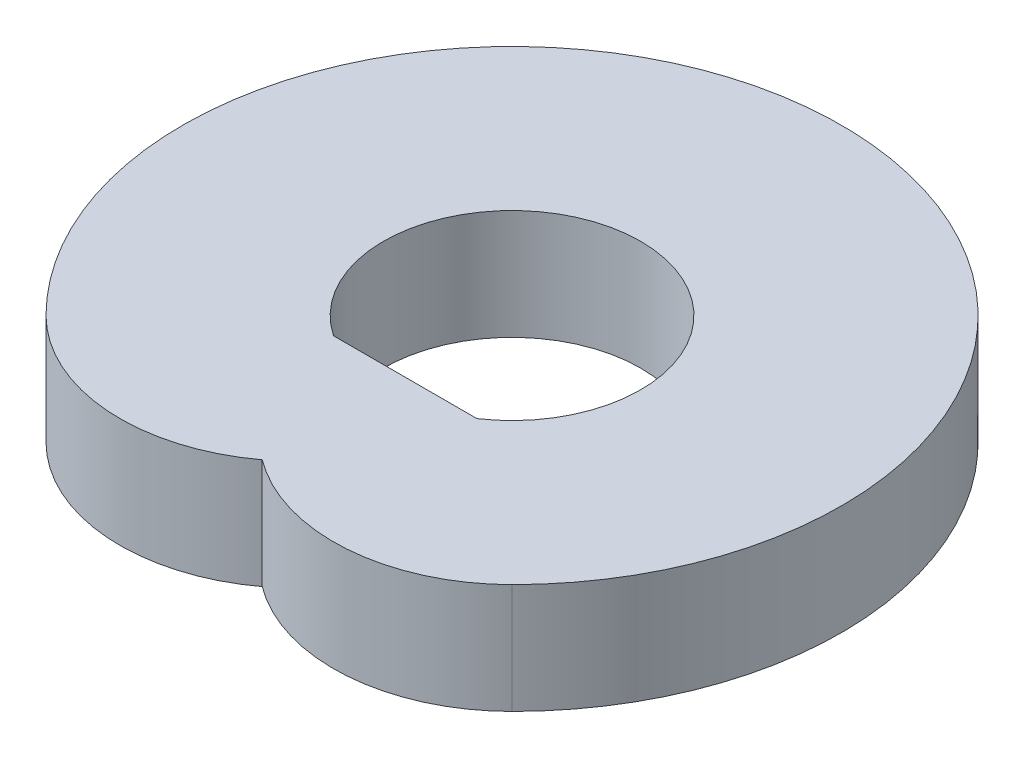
ISO-10303-21;
HEADER;
FILE_DESCRIPTION(('STEP AP214'),'2;1');
FILE_NAME('part.step','',(''),(''),'','','');
FILE_SCHEMA(('AUTOMOTIVE_DESIGN { 1 0 10303 214 1 1 1 1 }'));
ENDSEC;
DATA;
#1=APPLICATION_CONTEXT('core data for automotive mechanical design processes');
#2=APPLICATION_PROTOCOL_DEFINITION('international standard','automotive_design',2000,#1);
#3=PRODUCT_CONTEXT('',#1,'mechanical');
#4=PRODUCT('Part','Part','',(#3));
#5=PRODUCT_RELATED_PRODUCT_CATEGORY('part','',(#4));
#6=PRODUCT_DEFINITION_FORMATION('','',#4);
#7=PRODUCT_DEFINITION_CONTEXT('part definition',#1,'design');
#8=PRODUCT_DEFINITION('design','',#6,#7);
#9=PRODUCT_DEFINITION_SHAPE('','',#8);
#10=(LENGTH_UNIT() NAMED_UNIT(*) SI_UNIT(.MILLI.,.METRE.));
#11=(NAMED_UNIT(*) PLANE_ANGLE_UNIT() SI_UNIT($,.RADIAN.));
#12=(NAMED_UNIT(*) SI_UNIT($,.STERADIAN.) SOLID_ANGLE_UNIT());
#13=UNCERTAINTY_MEASURE_WITH_UNIT(LENGTH_MEASURE(1.E-05),#10,'distance_accuracy_value','');
#14=(GEOMETRIC_REPRESENTATION_CONTEXT(3) GLOBAL_UNCERTAINTY_ASSIGNED_CONTEXT((#13)) GLOBAL_UNIT_ASSIGNED_CONTEXT((#10,
#11,#12)) REPRESENTATION_CONTEXT('',''));
#15=CARTESIAN_POINT('',(0.,0.,0.));
#16=DIRECTION('',(0.,0.,1.));
#17=DIRECTION('',(1.,0.,0.));
#18=AXIS2_PLACEMENT_3D('',#15,#16,#17);
#19=CARTESIAN_POINT('',(97.2271824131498,200.,97.2271824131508));
#20=DIRECTION('',(0.,1.,0.));
#21=DIRECTION('',(0.,0.,1.));
#22=AXIS2_PLACEMENT_3D('',#19,#20,#21);
#23=PLANE('',#22);
#24=CARTESIAN_POINT('',(194.4543648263,200.,194.454364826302));
#25=DIRECTION('',(0.,1.,0.));
#26=DIRECTION('',(0.,0.,1.));
#27=AXIS2_PLACEMENT_3D('',#24,#25,#26);
#28=CIRCLE('',#27,324.999999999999);
#29=CARTESIAN_POINT('',(1.27675647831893E-12,200.,454.862698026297));
#30=VERTEX_POINT('',#29);
#31=CARTESIAN_POINT('',(424.264068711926,200.,424.264068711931));
#32=VERTEX_POINT('',#31);
#33=EDGE_CURVE('E98',#30,#32,#28,.T.);
#34=ORIENTED_EDGE('',*,*,#33,.T.);
#35=CARTESIAN_POINT('',(0.,200.,0.));
#36=DIRECTION('',(0.,1.,0.));
#37=DIRECTION('',(0.,0.,1.));
#38=AXIS2_PLACEMENT_3D('',#35,#36,#37);
#39=CIRCLE('',#38,600.);
#40=CARTESIAN_POINT('',(-424.264068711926,200.,424.264068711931));
#41=VERTEX_POINT('',#40);
#42=EDGE_CURVE('E101',#32,#41,#39,.T.);
#43=ORIENTED_EDGE('',*,*,#42,.T.);
#44=CARTESIAN_POINT('',(-194.454364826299,200.,194.454364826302));
#45=DIRECTION('',(0.,1.,0.));
#46=DIRECTION('',(0.,0.,1.));
#47=AXIS2_PLACEMENT_3D('',#44,#45,#46);
#48=CIRCLE('',#47,325.);
#49=EDGE_CURVE('E104',#41,#30,#48,.T.);
#50=ORIENTED_EDGE('',*,*,#49,.T.);
#51=EDGE_LOOP('',(#34,#43,#50));
#52=FACE_BOUND('',#51,.T.);
#53=DIRECTION('',(1.,0.,0.));
#54=VECTOR('',#53,1.);
#55=CARTESIAN_POINT('',(130.545635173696,200.,194.454364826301));
#56=LINE('',#55,#54);
#57=CARTESIAN_POINT('',(-130.545635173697,200.,194.4543648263));
#58=VERTEX_POINT('',#57);
#59=CARTESIAN_POINT('',(130.545635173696,200.,194.454364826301));
#60=VERTEX_POINT('',#59);
#61=EDGE_CURVE('E81',#58,#60,#56,.T.);
#62=ORIENTED_EDGE('',*,*,#61,.F.);
#63=CARTESIAN_POINT('',(0.,200.,0.));
#64=DIRECTION('',(0.,1.,0.));
#65=DIRECTION('',(0.,0.,1.));
#66=AXIS2_PLACEMENT_3D('',#63,#64,#65);
#67=CIRCLE('',#66,234.210723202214);
#68=EDGE_CURVE('E87',#60,#58,#67,.T.);
#69=ORIENTED_EDGE('',*,*,#68,.F.);
#70=EDGE_LOOP('',(#62,#69));
#71=FACE_BOUND('',#70,.T.);
#72=ADVANCED_FACE('F35',(#52,#71),#23,.T.);
#73=CARTESIAN_POINT('',(97.2271824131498,0.,97.2271824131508));
#74=DIRECTION('',(0.,1.,0.));
#75=DIRECTION('',(0.,0.,1.));
#76=AXIS2_PLACEMENT_3D('',#73,#74,#75);
#77=PLANE('',#76);
#78=CARTESIAN_POINT('',(194.4543648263,0.,194.454364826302));
#79=DIRECTION('',(0.,1.,0.));
#80=DIRECTION('',(0.,0.,1.));
#81=AXIS2_PLACEMENT_3D('',#78,#79,#80);
#82=CIRCLE('',#81,324.999999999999);
#83=CARTESIAN_POINT('',(1.27675647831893E-12,0.,454.862698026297));
#84=VERTEX_POINT('',#83);
#85=CARTESIAN_POINT('',(424.264068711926,0.,424.264068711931));
#86=VERTEX_POINT('',#85);
#87=EDGE_CURVE('E97',#84,#86,#82,.T.);
#88=ORIENTED_EDGE('',*,*,#87,.F.);
#89=CARTESIAN_POINT('',(-194.454364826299,0.,194.454364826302));
#90=DIRECTION('',(0.,1.,0.));
#91=DIRECTION('',(0.,0.,1.));
#92=AXIS2_PLACEMENT_3D('',#89,#90,#91);
#93=CIRCLE('',#92,325.);
#94=CARTESIAN_POINT('',(-424.264068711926,0.,424.264068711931));
#95=VERTEX_POINT('',#94);
#96=EDGE_CURVE('E102',#95,#84,#93,.T.);
#97=ORIENTED_EDGE('',*,*,#96,.F.);
#98=CARTESIAN_POINT('',(0.,0.,0.));
#99=DIRECTION('',(0.,1.,0.));
#100=DIRECTION('',(0.,0.,1.));
#101=AXIS2_PLACEMENT_3D('',#98,#99,#100);
#102=CIRCLE('',#101,600.);
#103=EDGE_CURVE('E109',#86,#95,#102,.T.);
#104=ORIENTED_EDGE('',*,*,#103,.F.);
#105=EDGE_LOOP('',(#88,#97,#104));
#106=FACE_BOUND('',#105,.T.);
#107=CARTESIAN_POINT('',(0.,0.,0.));
#108=DIRECTION('',(0.,1.,0.));
#109=DIRECTION('',(0.,0.,1.));
#110=AXIS2_PLACEMENT_3D('',#107,#108,#109);
#111=CIRCLE('',#110,234.210723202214);
#112=CARTESIAN_POINT('',(130.545635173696,0.,194.454364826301));
#113=VERTEX_POINT('',#112);
#114=CARTESIAN_POINT('',(-130.545635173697,0.,194.4543648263));
#115=VERTEX_POINT('',#114);
#116=EDGE_CURVE('E57',#113,#115,#111,.T.);
#117=ORIENTED_EDGE('',*,*,#116,.T.);
#118=DIRECTION('',(1.,0.,0.));
#119=VECTOR('',#118,1.);
#120=CARTESIAN_POINT('',(130.545635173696,0.,194.454364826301));
#121=LINE('',#120,#119);
#122=EDGE_CURVE('E91',#115,#113,#121,.T.);
#123=ORIENTED_EDGE('',*,*,#122,.T.);
#124=EDGE_LOOP('',(#117,#123));
#125=FACE_BOUND('',#124,.T.);
#126=ADVANCED_FACE('F123',(#106,#125),#77,.F.);
#127=CARTESIAN_POINT('',(194.4543648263,200.,194.454364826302));
#128=DIRECTION('',(0.,-1.,0.));
#129=DIRECTION('',(0.,0.,-1.));
#130=AXIS2_PLACEMENT_3D('',#127,#128,#129);
#131=CYLINDRICAL_SURFACE('',#130,324.999999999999);
#132=ORIENTED_EDGE('',*,*,#87,.T.);
#133=DIRECTION('',(0.,-1.,0.));
#134=VECTOR('',#133,1.);
#135=CARTESIAN_POINT('',(424.264068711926,200.,424.264068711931));
#136=LINE('',#135,#134);
#137=EDGE_CURVE('E11',#32,#86,#136,.T.);
#138=ORIENTED_EDGE('',*,*,#137,.F.);
#139=ORIENTED_EDGE('',*,*,#33,.F.);
#140=DIRECTION('',(0.,-1.,0.));
#141=VECTOR('',#140,1.);
#142=CARTESIAN_POINT('',(1.27675647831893E-12,200.,454.862698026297));
#143=LINE('',#142,#141);
#144=EDGE_CURVE('E106',#30,#84,#143,.T.);
#145=ORIENTED_EDGE('',*,*,#144,.T.);
#146=EDGE_LOOP('',(#132,#138,#139,#145));
#147=FACE_BOUND('',#146,.T.);
#148=ADVANCED_FACE('F37',(#147),#131,.T.);
#149=CARTESIAN_POINT('',(0.,200.,0.));
#150=DIRECTION('',(0.,-1.,0.));
#151=DIRECTION('',(0.,0.,-1.));
#152=AXIS2_PLACEMENT_3D('',#149,#150,#151);
#153=CYLINDRICAL_SURFACE('',#152,600.);
#154=ORIENTED_EDGE('',*,*,#103,.T.);
#155=DIRECTION('',(0.,-1.,0.));
#156=VECTOR('',#155,1.);
#157=CARTESIAN_POINT('',(-424.264068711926,200.,424.264068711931));
#158=LINE('',#157,#156);
#159=EDGE_CURVE('E43',#41,#95,#158,.T.);
#160=ORIENTED_EDGE('',*,*,#159,.F.);
#161=ORIENTED_EDGE('',*,*,#42,.F.);
#162=ORIENTED_EDGE('',*,*,#137,.T.);
#163=EDGE_LOOP('',(#154,#160,#161,#162));
#164=FACE_BOUND('',#163,.T.);
#165=ADVANCED_FACE('F129',(#164),#153,.T.);
#166=CARTESIAN_POINT('',(-194.454364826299,200.,194.454364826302));
#167=DIRECTION('',(0.,-1.,0.));
#168=DIRECTION('',(0.,0.,-1.));
#169=AXIS2_PLACEMENT_3D('',#166,#167,#168);
#170=CYLINDRICAL_SURFACE('',#169,325.);
#171=ORIENTED_EDGE('',*,*,#96,.T.);
#172=ORIENTED_EDGE('',*,*,#144,.F.);
#173=ORIENTED_EDGE('',*,*,#49,.F.);
#174=ORIENTED_EDGE('',*,*,#159,.T.);
#175=EDGE_LOOP('',(#171,#172,#173,#174));
#176=FACE_BOUND('',#175,.T.);
#177=ADVANCED_FACE('F118',(#176),#170,.T.);
#178=CARTESIAN_POINT('',(0.,200.,0.));
#179=DIRECTION('',(0.,-1.,0.));
#180=DIRECTION('',(0.,0.,-1.));
#181=AXIS2_PLACEMENT_3D('',#178,#179,#180);
#182=CYLINDRICAL_SURFACE('',#181,234.210723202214);
#183=ORIENTED_EDGE('',*,*,#116,.F.);
#184=DIRECTION('',(0.,-1.,0.));
#185=VECTOR('',#184,1.);
#186=CARTESIAN_POINT('',(130.545635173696,200.,194.454364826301));
#187=LINE('',#186,#185);
#188=EDGE_CURVE('E83',#60,#113,#187,.T.);
#189=ORIENTED_EDGE('',*,*,#188,.F.);
#190=ORIENTED_EDGE('',*,*,#68,.T.);
#191=DIRECTION('',(0.,-1.,0.));
#192=VECTOR('',#191,1.);
#193=CARTESIAN_POINT('',(-130.545635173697,200.,194.4543648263));
#194=LINE('',#193,#192);
#195=EDGE_CURVE('E50',#58,#115,#194,.T.);
#196=ORIENTED_EDGE('',*,*,#195,.T.);
#197=EDGE_LOOP('',(#183,#189,#190,#196));
#198=FACE_BOUND('',#197,.T.);
#199=ADVANCED_FACE('F89',(#198),#182,.F.);
#200=CARTESIAN_POINT('',(130.545635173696,200.,194.454364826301));
#201=DIRECTION('',(0.,0.,-1.));
#202=DIRECTION('',(-1.,0.,0.));
#203=AXIS2_PLACEMENT_3D('',#200,#201,#202);
#204=PLANE('',#203);
#205=ORIENTED_EDGE('',*,*,#122,.F.);
#206=ORIENTED_EDGE('',*,*,#195,.F.);
#207=ORIENTED_EDGE('',*,*,#61,.T.);
#208=ORIENTED_EDGE('',*,*,#188,.T.);
#209=EDGE_LOOP('',(#205,#206,#207,#208));
#210=FACE_BOUND('',#209,.T.);
#211=ADVANCED_FACE('F82',(#210),#204,.T.);
#212=CLOSED_SHELL('',(#72,#126,#148,#165,#177,#199,#211));
#213=MANIFOLD_SOLID_BREP('B2',#212);
#214=ADVANCED_BREP_SHAPE_REPRESENTATION('',(#18,#213),#14);
#215=SHAPE_DEFINITION_REPRESENTATION(#9,#214);
ENDSEC;
END-ISO-10303-21;
